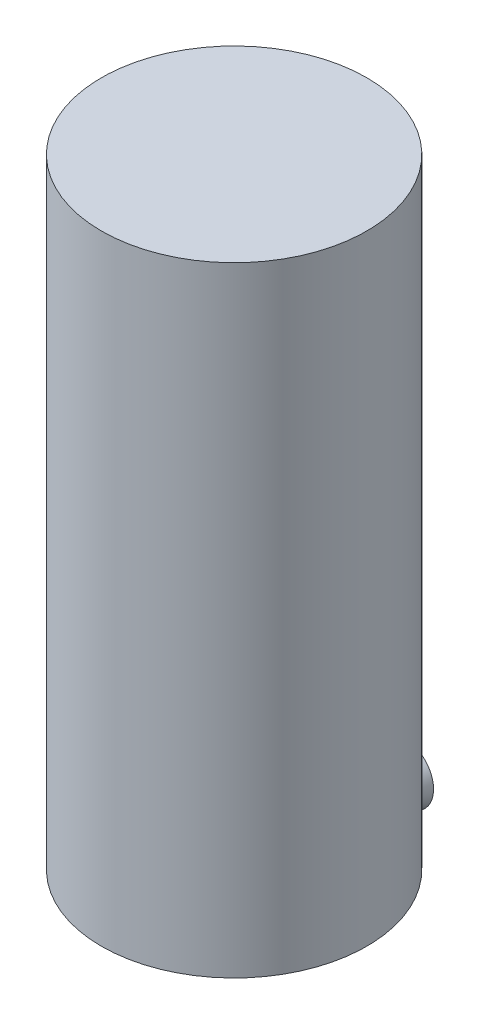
from build123d import *

# Parameters (mm, degrees)
SKETCH1_R      = 38.1
EXTRUDE1_DEPTH = 177.8


with BuildPart() as part:
    # Sketch1 → Extrude1 (new body)
    with BuildSketch(Plane(origin=(0, 0, 0), x_dir=(1, 0, 0), z_dir=(0, 1, 0))):
        with Locations(Location((0, 0, 0), (0, 0, 270))):
            Circle(SKETCH1_R)
    extrude(amount=EXTRUDE1_DEPTH)


with BuildPart() as body_2:
    # Sketch5 → Revolve1 (revolve)
    with BuildSketch(Plane(origin=(0, 0, 0), x_dir=(0, 0, -1), z_dir=(1, 0, 0)), mode=Mode.PRIVATE) as revolve1_sk:
        with BuildLine():
            Line((48.62102509, 0), (48.62102509, 8.62781122))
            Line((48.62102509, 8.62781122), (37.443219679, 4.664619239))
            ThreePointArc((37.443219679, 4.664619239), (35.054869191, 2.855582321), (34.147961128, 0))
            Line((34.147961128, 0), (48.62102509, 0))
        make_face()
    revolve(revolve1_sk.sketch.rotate(Axis((0, 0, -33.099962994), (0, 0, -1)), 180), axis=Axis((0, 0, -33.099962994), (0, 0, -1)))


solid = Compound([part.part, body_2.part])
